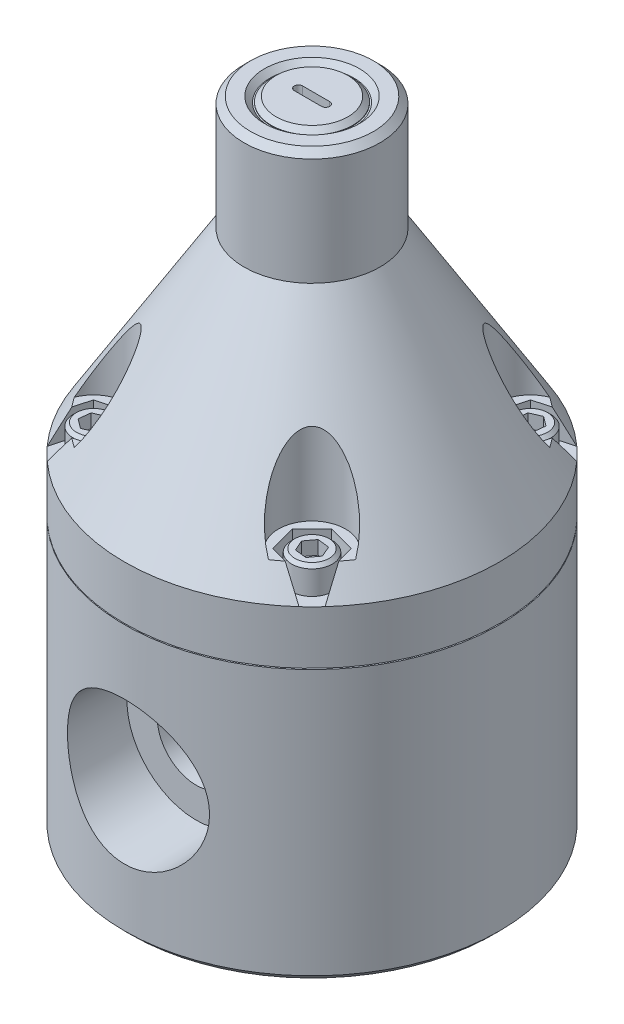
from build123d import *

# Parameters (mm, degrees)
SKETCH1_R         = 43.815
EXTRUDE1_DEPTH    = 148.59
CHAMFER1_SIZE     = 1.524
SKETCH3_R         = 11.1125
EXTRUDE2_DEPTH    = 1.27
EXTRUDE2_DRAFT    = -45
SKETCH4_R         = 9.525
EXTRUDE3_DEPTH    = 1.27
CHAMFER2_SIZE     = 1.143
EXTRUDE4_DEPTH    = 3.175
EXTRUDE4_DRAFT    = -1
SKETCH6_R         = 7.874
EXTRUDE5_DEPTH    = 22.86
EXTRUDE6_DEPTH    = 6.35
SKETCH8_R         = 4.7625
EXTRUDE7_DEPTH    = 6.35
EXTRUDE8_DEPTH    = 3.175
CIRPATTERN1_COUNT = 4
CHAMFER3_SIZE     = 0.762


with BuildPart() as part:
    # Sketch1 → Extrude1 (new body)
    with BuildSketch(Plane(origin=(0, 0, 0), x_dir=(1, 0, 0), z_dir=(0, 1, 0))):
        with Locations(Location((0, 0, 0), (0, 0, 270))):
            Circle(SKETCH1_R)
    extrude(amount=EXTRUDE1_DEPTH)

    # Sketch2 → Cut-Revolve1 (revolve, cut)
    with BuildSketch(Plane.XY, mode=Mode.PRIVATE) as cut_revolve1_sk:
        Polygon((-52.628834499, 63.5), (-30.226, 63.5), (-30.226, 63.754), (-43.815, 63.754), (-43.815, 76.2), (-15.875, 121.92), (-15.875, 152.4), (-52.628834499, 152.4), align=None)
    revolve(cut_revolve1_sk.sketch.rotate(Axis((0, 148.59, 0), (0, -1, 0)), 270), axis=Axis((0, 148.59, 0), (0, -1, 0)), mode=Mode.SUBTRACT)

    # Chamfer1
    chamfer1_edges = [part.edges().sort_by_distance(p)[0] for p in [
        (0, 0, -43.815),
        (0, 148.59, -15.875),
    ]]
    chamfer(chamfer1_edges, length=CHAMFER1_SIZE)


with BuildPart() as extrude2_tool:
    # Sketch3 → Extrude2 (with draft: the straight prism first)
    with BuildSketch(Plane(origin=(0, 148.59, 0), x_dir=(-1, 0, 0), z_dir=(0, 1, 0))):
        Circle(SKETCH3_R)
    extrude(amount=-EXTRUDE2_DEPTH)
    # Extrude2: the draft: its side faces are tilted about the plane it starts from
    extrude2_sides = [extrude2_tool.faces().sort_by_distance(p)[0] for p in [
        (11.1125, 147.955, 0),
    ]]
    draft(extrude2_sides, Plane(origin=(0, 148.59, 0), x_dir=(-1, 0, 0), z_dir=(0, 1, 0)), EXTRUDE2_DRAFT)


with BuildPart() as part_1:
    add(part.part)

    # Extrude2: cut by extrude2_tool
    add(extrude2_tool.part, mode=Mode.SUBTRACT)

    # Sketch4 → Extrude3 (add)
    with BuildSketch(Plane(origin=(0, 148.59, 0), x_dir=(-1, 0, 0), z_dir=(0, 1, 0))):
        with Locations(Location((0, 0, 0), (0, 0, 90))):
            Circle(SKETCH4_R)
    extrude(amount=-EXTRUDE3_DEPTH)

    # Chamfer2
    chamfer2_edges = [part_1.edges().sort_by_distance(p)[0] for p in [
        (0, 148.59, -9.525),
    ]]
    chamfer(chamfer2_edges, length=CHAMFER2_SIZE)


with BuildPart() as extrude4_tool:
    # Sketch5 → Extrude4 (with draft: the straight prism first)
    with BuildSketch(Plane(origin=(0, 148.59, 0), x_dir=(-1, 0, 0), z_dir=(0, 1, 0))):
        with BuildLine():
            Line((3.175, 0.9652), (-3.175, 0.9652))
            ThreePointArc((-3.175, 0.9652), (-4.1402, 0), (-3.175, -0.9652))
            Line((-3.175, -0.9652), (3.175, -0.9652))
            ThreePointArc((3.175, -0.9652), (4.1402, 0), (3.175, 0.9652))
        make_face()
    extrude(amount=-EXTRUDE4_DEPTH)
    # Extrude4: the draft: its side faces are tilted about the plane it starts from
    extrude4_sides = [extrude4_tool.faces().sort_by_distance(p)[0] for p in [
        (0, 147.0025, 0.9652),
        (4.1402, 147.0025, 0),
        (0, 147.0025, -0.9652),
        (-4.1402, 147.0025, 0),
    ]]
    draft(extrude4_sides, Plane(origin=(0, 148.59, 0), x_dir=(-1, 0, 0), z_dir=(0, 1, 0)), EXTRUDE4_DRAFT)


with BuildPart() as part_2:
    add(part_1.part)

    # Extrude4: cut by extrude4_tool
    add(extrude4_tool.part, mode=Mode.SUBTRACT)

    # Sketch6 → Extrude5 (cut)
    with BuildSketch(Plane(origin=(0, 82.55, 0), x_dir=(-1, 0, 0), z_dir=(0, 1, 0))):
        with Locations((-25.521887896, 25.521887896)):
            Circle(SKETCH6_R)
    extrude5 = extrude(amount=EXTRUDE5_DEPTH, mode=Mode.SUBTRACT)

    # Sketch7 → Extrude6 (cut)
    with BuildSketch(Plane(origin=(0, 82.55, 0), x_dir=(-1, 0, 0), z_dir=(0, 1, 0))):
        Polygon((-30.08447079, 20.959305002), (-23.85186665, 19.289283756), (-19.289283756, 23.85186665), (-20.959305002, 30.08447079), (-33.653634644, 33.653634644), align=None)
    extrude6 = extrude(amount=-EXTRUDE6_DEPTH, mode=Mode.SUBTRACT)

    # Sketch8 → Extrude7 (add)
    with BuildSketch(Plane(origin=(0, 82.55, 0), x_dir=(-1, 0, 0), z_dir=(0, 1, 0))):
        with Locations(Location((-25.521887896, 25.521887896, 0), (0, 0, 90))):
            Circle(SKETCH8_R)
    extrude7 = extrude(amount=-EXTRUDE7_DEPTH)

    # Sketch9 → Extrude8 (cut)
    with BuildSketch(Plane(origin=(0, 82.55, 0), x_dir=(-1, 0, 0), z_dir=(0, 1, 0))):
        Polygon((-23.873856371, 27.745151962), (-26.623275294, 28.060757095), (-28.271306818, 25.83749303), (-27.169919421, 23.298623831), (-24.420500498, 22.983018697), (-22.772468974, 25.206282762), align=None)
    extrude8 = extrude(amount=-EXTRUDE8_DEPTH, mode=Mode.SUBTRACT)

    # CirPattern1: Extrude5, Extrude6, Extrude7, Extrude8 ×4 about axis
    cirpattern1_axis = Axis((0, 0, 0), (0, 1, 0))
    add([extrude5.rotate(cirpattern1_axis, i * 360 / CIRPATTERN1_COUNT) for i in range(1, CIRPATTERN1_COUNT)], mode=Mode.SUBTRACT)
    add([extrude6.rotate(cirpattern1_axis, i * 360 / CIRPATTERN1_COUNT) for i in range(1, CIRPATTERN1_COUNT)], mode=Mode.SUBTRACT)
    add([extrude7.rotate(cirpattern1_axis, i * 360 / CIRPATTERN1_COUNT) for i in range(1, CIRPATTERN1_COUNT)])
    add([extrude8.rotate(cirpattern1_axis, i * 360 / CIRPATTERN1_COUNT) for i in range(1, CIRPATTERN1_COUNT)], mode=Mode.SUBTRACT)

    # Chamfer3
    chamfer3_edges = [part_2.edges().sort_by_distance(p)[0] for p in [
        (-20.759387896, 82.55, 25.521887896),
        (-25.521887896, 82.55, -20.759387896),
        (20.759387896, 82.55, -25.521887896),
        (25.521887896, 82.55, 20.759387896),
    ]]
    chamfer(chamfer3_edges, length=CHAMFER3_SIZE)

    # Sketch12 → 1 NPT Tapped Hole1 (revolve, cut)
    with BuildSketch(Plane(origin=(0, 31.75, 43.815), x_dir=(0, -1, 0), z_dir=(1, 0, 0))):
        Polygon((0, 0), (0, 30.879007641), (9.1186, 25.4), (9.1186, 16.764), (16.19787759, 16.764), (16.6998142, 0), align=None)
    f_1_npt_tapped_hole1 = revolve(axis=Axis((0, 31.75, 50.165), (0, 0, -1)), mode=Mode.SUBTRACT)

    # Mirror1: 1 NPT Tapped Hole1 across plane
    add(f_1_npt_tapped_hole1.mirror(Plane.XY), mode=Mode.SUBTRACT)


solid = part_2.part
